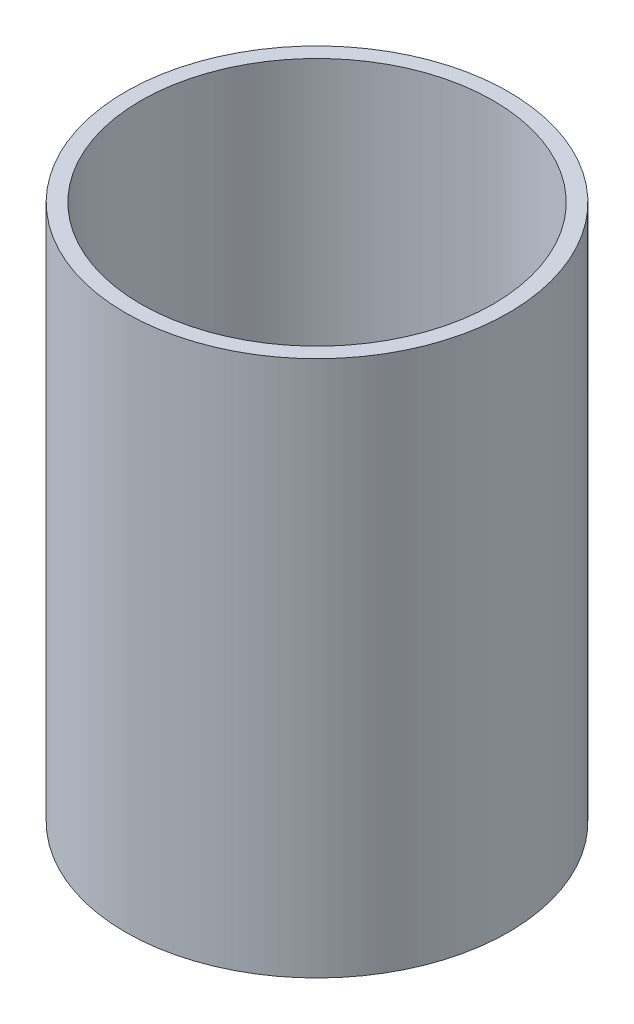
from build123d import *

# Parameters (mm, degrees)
SKETCH1_R      = 12.5
SKETCH1_R_2    = 11.5
EXTRUDE1_DEPTH = 35


with BuildPart() as part:
    # Sketch1 → Extrude1 (new body)
    with BuildSketch(Plane(origin=(0, 0, 0), x_dir=(1, 0, 0), z_dir=(0, 1, 0))):
        with Locations(Location((0, 0, 0), (0, 0, 270))):
            Circle(SKETCH1_R)
        with Locations(Location((0, 0, 0), (0, 0, 270))):
            Circle(SKETCH1_R_2, mode=Mode.SUBTRACT)
    extrude(amount=EXTRUDE1_DEPTH)


solid = part.part
